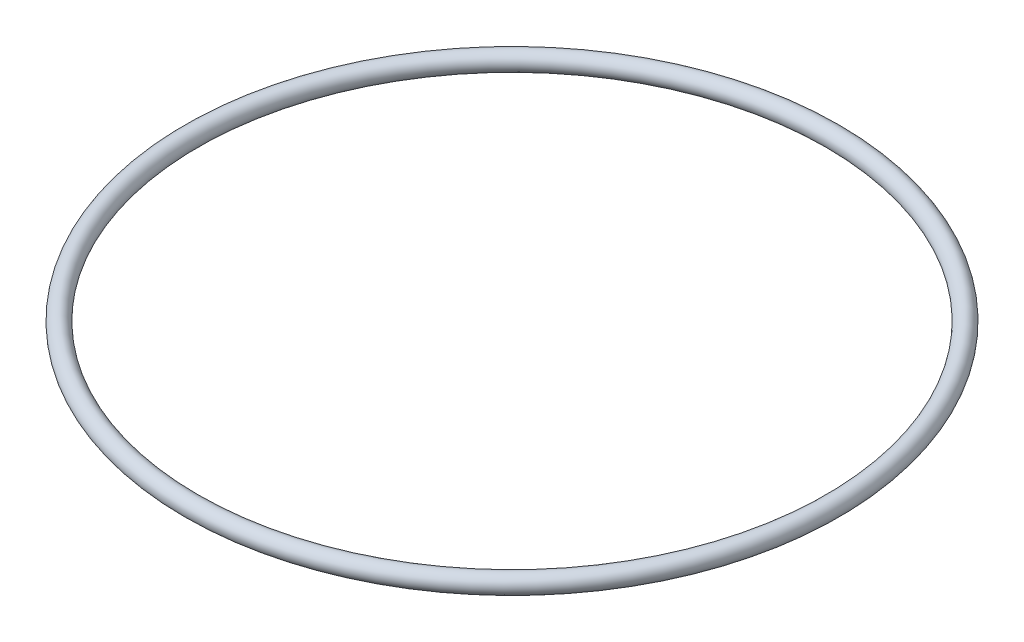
ISO-10303-21;
HEADER;
FILE_DESCRIPTION(('STEP AP214'),'2;1');
FILE_NAME('part.step','',(''),(''),'','','');
FILE_SCHEMA(('AUTOMOTIVE_DESIGN { 1 0 10303 214 1 1 1 1 }'));
ENDSEC;
DATA;
#1=APPLICATION_CONTEXT('core data for automotive mechanical design processes');
#2=APPLICATION_PROTOCOL_DEFINITION('international standard','automotive_design',2000,#1);
#3=PRODUCT_CONTEXT('',#1,'mechanical');
#4=PRODUCT('Part','Part','',(#3));
#5=PRODUCT_RELATED_PRODUCT_CATEGORY('part','',(#4));
#6=PRODUCT_DEFINITION_FORMATION('','',#4);
#7=PRODUCT_DEFINITION_CONTEXT('part definition',#1,'design');
#8=PRODUCT_DEFINITION('design','',#6,#7);
#9=PRODUCT_DEFINITION_SHAPE('','',#8);
#10=(LENGTH_UNIT() NAMED_UNIT(*) SI_UNIT(.MILLI.,.METRE.));
#11=(NAMED_UNIT(*) PLANE_ANGLE_UNIT() SI_UNIT($,.RADIAN.));
#12=(NAMED_UNIT(*) SI_UNIT($,.STERADIAN.) SOLID_ANGLE_UNIT());
#13=UNCERTAINTY_MEASURE_WITH_UNIT(LENGTH_MEASURE(1.E-05),#10,'distance_accuracy_value','');
#14=(GEOMETRIC_REPRESENTATION_CONTEXT(3) GLOBAL_UNCERTAINTY_ASSIGNED_CONTEXT((#13)) GLOBAL_UNIT_ASSIGNED_CONTEXT((#10,
#11,#12)) REPRESENTATION_CONTEXT('',''));
#15=CARTESIAN_POINT('',(0.,0.,0.));
#16=DIRECTION('',(0.,0.,1.));
#17=DIRECTION('',(1.,0.,0.));
#18=AXIS2_PLACEMENT_3D('',#15,#16,#17);
#19=CARTESIAN_POINT('',(0.,0.,0.));
#20=DIRECTION('',(0.,1.,0.));
#21=DIRECTION('',(0.,0.,1.));
#22=AXIS2_PLACEMENT_3D('',#19,#20,#21);
#23=TOROIDAL_SURFACE('',#22,52.500000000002,1.50000000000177);
#24=CARTESIAN_POINT('',(0.,0.,54.0000000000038));
#25=VERTEX_POINT('',#24);
#26=VERTEX_LOOP('',#25);
#27=FACE_BOUND('',#26,.T.);
#28=ADVANCED_FACE('F29',(#27),#23,.T.);
#29=CLOSED_SHELL('',(#28));
#30=MANIFOLD_SOLID_BREP('B2',#29);
#31=ADVANCED_BREP_SHAPE_REPRESENTATION('',(#18,#30),#14);
#32=SHAPE_DEFINITION_REPRESENTATION(#9,#31);
ENDSEC;
END-ISO-10303-21;
